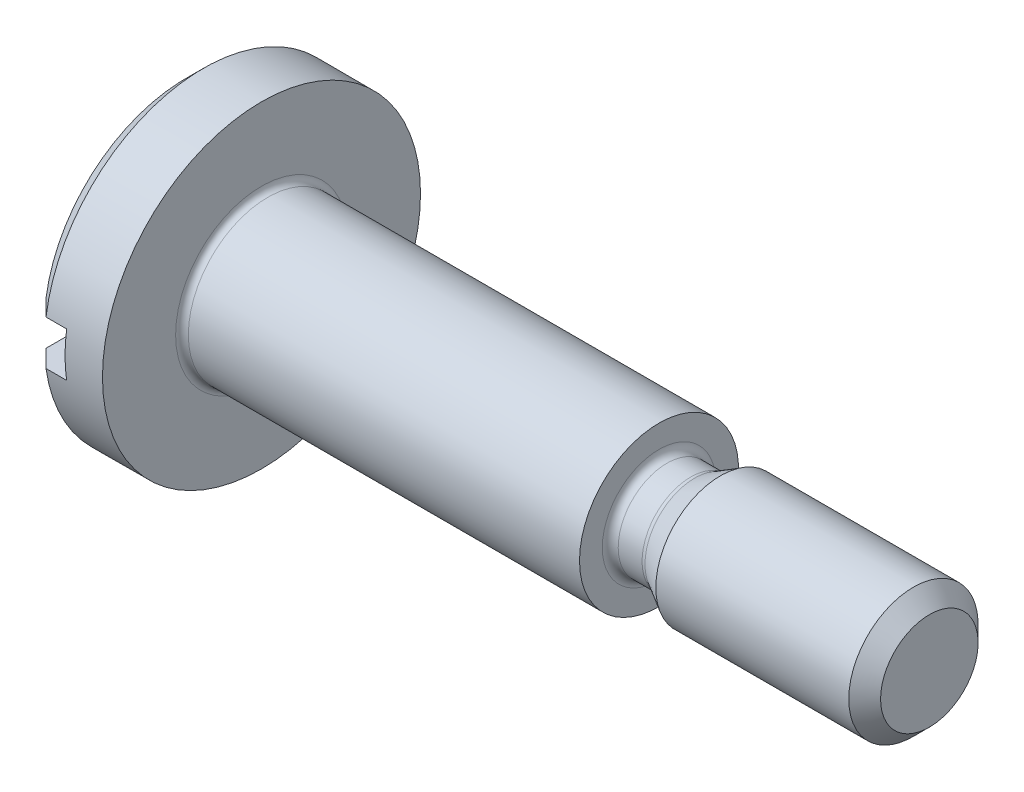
from build123d import *

# Parameters (mm, degrees)
FILLET1_R  = 0.4
SKETCH2_W  = 20
SKETCH2_H  = 2.8
SLOT_DEPTH = 2.4


with BuildPart() as part:
    # BodySke → Base-Revolve (revolve)
    with BuildSketch(Plane.XY, mode=Mode.PRIVATE) as base_revolve_sk:
        with BuildLine():
            Line((4.75, 5), (4.75, 10))
            Line((4.75, 10), (1.1, 10))
            Line((1.1, 10), (0, 8.9))
            Line((0, 8.9), (0, 0))
            Line((0, 0), (46.75, 0))
            Line((46.75, 0), (46.75, 3.066266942))
            Line((46.75, 3.066266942), (45.75, 4.066266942))
            Line((45.75, 4.066266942), (33.616025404, 4.066266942))
            Line((33.616025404, 4.066266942), (32, 3.133254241))
            ThreePointArc((32, 3.133254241), (31.879409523, 3.083304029), (31.75, 3.066266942))
            Line((31.75, 3.066266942), (30.25, 3.066266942))
            ThreePointArc((30.25, 3.066266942), (29.896446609, 3.212713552), (29.75, 3.566266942))
            Line((29.75, 3.566266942), (29.75, 5))
            Line((29.75, 5), (4.75, 5))
        make_face()
    revolve(base_revolve_sk.sketch.rotate(Axis((-25.4, 0, 0), (1, 0, 0)), 90), axis=Axis((-25.4, 0, 0), (1, 0, 0)))

    # Fillet1
    fillet1_edges = [part.edges().sort_by_distance(p)[0] for p in [
        (4.75, 0, -5),
    ]]
    fillet(fillet1_edges, radius=FILLET1_R)

    # Sketch2 → Slot (cut)
    with BuildSketch(Plane(origin=(0, 0, 0), x_dir=(0, 0, -1), z_dir=(1, 0, 0))):
        Rectangle(SKETCH2_W, SKETCH2_H)
    extrude(amount=SLOT_DEPTH, mode=Mode.SUBTRACT)


solid = part.part
